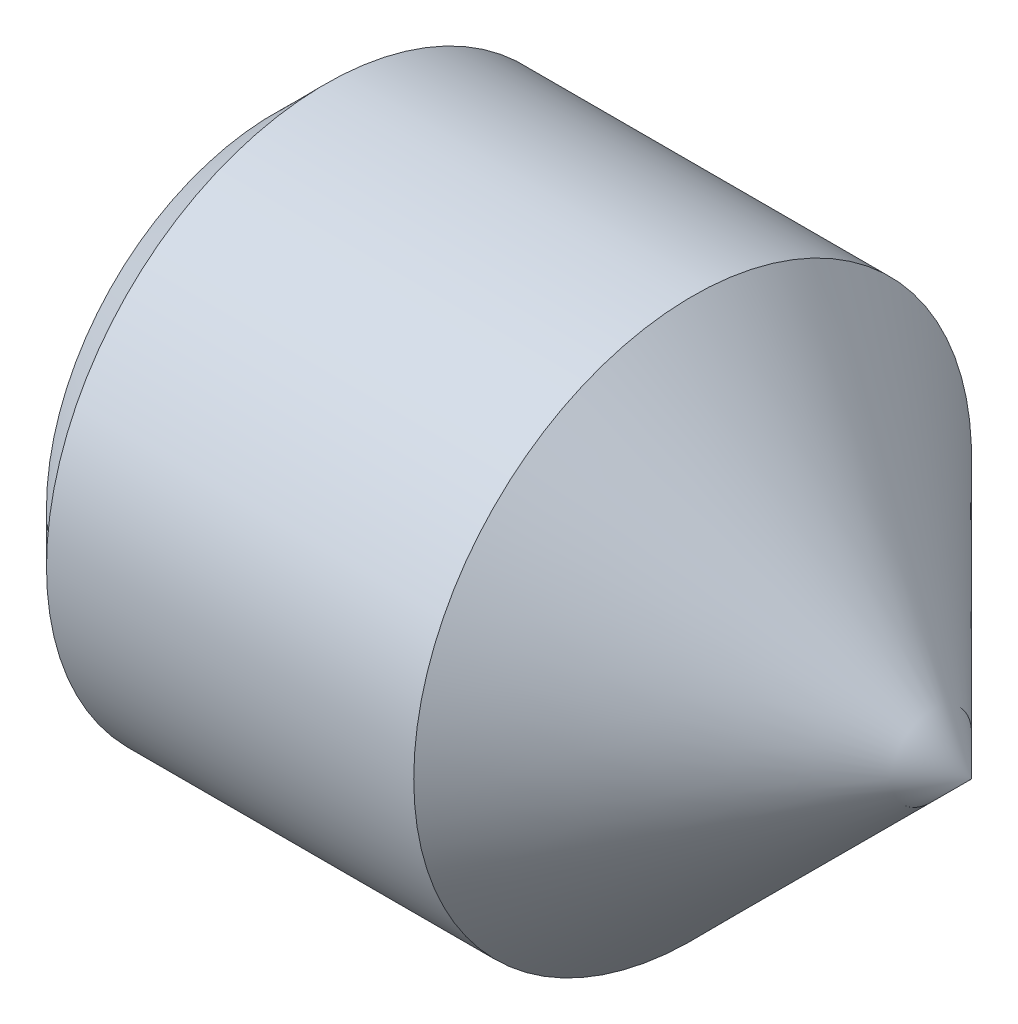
ISO-10303-21;
HEADER;
FILE_DESCRIPTION(('STEP AP214'),'2;1');
FILE_NAME('part.step','',(''),(''),'','','');
FILE_SCHEMA(('AUTOMOTIVE_DESIGN { 1 0 10303 214 1 1 1 1 }'));
ENDSEC;
DATA;
#1=APPLICATION_CONTEXT('core data for automotive mechanical design processes');
#2=APPLICATION_PROTOCOL_DEFINITION('international standard','automotive_design',2000,#1);
#3=PRODUCT_CONTEXT('',#1,'mechanical');
#4=PRODUCT('Part','Part','',(#3));
#5=PRODUCT_RELATED_PRODUCT_CATEGORY('part','',(#4));
#6=PRODUCT_DEFINITION_FORMATION('','',#4);
#7=PRODUCT_DEFINITION_CONTEXT('part definition',#1,'design');
#8=PRODUCT_DEFINITION('design','',#6,#7);
#9=PRODUCT_DEFINITION_SHAPE('','',#8);
#10=(LENGTH_UNIT() NAMED_UNIT(*) SI_UNIT(.MILLI.,.METRE.));
#11=(NAMED_UNIT(*) PLANE_ANGLE_UNIT() SI_UNIT($,.RADIAN.));
#12=(NAMED_UNIT(*) SI_UNIT($,.STERADIAN.) SOLID_ANGLE_UNIT());
#13=UNCERTAINTY_MEASURE_WITH_UNIT(LENGTH_MEASURE(1.E-05),#10,'distance_accuracy_value','');
#14=(GEOMETRIC_REPRESENTATION_CONTEXT(3) GLOBAL_UNCERTAINTY_ASSIGNED_CONTEXT((#13)) GLOBAL_UNIT_ASSIGNED_CONTEXT((#10,
#11,#12)) REPRESENTATION_CONTEXT('',''));
#15=CARTESIAN_POINT('',(0.,0.,0.));
#16=DIRECTION('',(0.,0.,1.));
#17=DIRECTION('',(1.,0.,0.));
#18=AXIS2_PLACEMENT_3D('',#15,#16,#17);
#19=CARTESIAN_POINT('',(0.,0.,0.));
#20=DIRECTION('',(-1.,0.,0.));
#21=DIRECTION('',(0.,0.,1.));
#22=AXIS2_PLACEMENT_3D('',#19,#20,#21);
#23=PLANE('',#22);
#24=CARTESIAN_POINT('',(0.,0.,0.));
#25=DIRECTION('',(-1.,0.,0.));
#26=DIRECTION('',(0.,0.,1.));
#27=AXIS2_PLACEMENT_3D('',#24,#25,#26);
#28=CIRCLE('',#27,5.18668);
#29=CARTESIAN_POINT('',(0.,0.,5.18668));
#30=VERTEX_POINT('',#29);
#31=EDGE_CURVE('E11',#30,#30,#28,.T.);
#32=ORIENTED_EDGE('',*,*,#31,.T.);
#33=EDGE_LOOP('',(#32));
#34=FACE_BOUND('',#33,.T.);
#35=DIRECTION('',(0.,0.,-1.));
#36=VECTOR('',#35,1.);
#37=CARTESIAN_POINT('',(0.,3.175,1.83308710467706));
#38=LINE('',#37,#36);
#39=CARTESIAN_POINT('',(0.,3.175,1.83308710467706));
#40=VERTEX_POINT('',#39);
#41=CARTESIAN_POINT('',(0.,3.175,-1.83308710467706));
#42=VERTEX_POINT('',#41);
#43=EDGE_CURVE('E93',#40,#42,#38,.T.);
#44=ORIENTED_EDGE('',*,*,#43,.F.);
#45=DIRECTION('',(0.,-0.866025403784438,0.5));
#46=VECTOR('',#45,1.);
#47=CARTESIAN_POINT('',(0.,3.175,1.83308710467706));
#48=LINE('',#47,#46);
#49=CARTESIAN_POINT('',(0.,0.,3.66617420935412));
#50=VERTEX_POINT('',#49);
#51=EDGE_CURVE('E46',#40,#50,#48,.T.);
#52=ORIENTED_EDGE('',*,*,#51,.T.);
#53=DIRECTION('',(0.,0.866025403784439,0.5));
#54=VECTOR('',#53,1.);
#55=CARTESIAN_POINT('',(0.,-3.175,1.83308710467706));
#56=LINE('',#55,#54);
#57=CARTESIAN_POINT('',(0.,-3.175,1.83308710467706));
#58=VERTEX_POINT('',#57);
#59=EDGE_CURVE('E99',#58,#50,#56,.T.);
#60=ORIENTED_EDGE('',*,*,#59,.F.);
#61=DIRECTION('',(0.,0.,-1.));
#62=VECTOR('',#61,1.);
#63=CARTESIAN_POINT('',(0.,-3.175,1.83308710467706));
#64=LINE('',#63,#62);
#65=CARTESIAN_POINT('',(0.,-3.175,-1.83308710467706));
#66=VERTEX_POINT('',#65);
#67=EDGE_CURVE('E119',#58,#66,#64,.T.);
#68=ORIENTED_EDGE('',*,*,#67,.T.);
#69=DIRECTION('',(0.,0.866025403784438,-0.5));
#70=VECTOR('',#69,1.);
#71=CARTESIAN_POINT('',(0.,-3.175,-1.83308710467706));
#72=LINE('',#71,#70);
#73=CARTESIAN_POINT('',(0.,0.,-3.66617420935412));
#74=VERTEX_POINT('',#73);
#75=EDGE_CURVE('E122',#66,#74,#72,.T.);
#76=ORIENTED_EDGE('',*,*,#75,.T.);
#77=DIRECTION('',(0.,-0.866025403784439,-0.5));
#78=VECTOR('',#77,1.);
#79=CARTESIAN_POINT('',(0.,3.175,-1.83308710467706));
#80=LINE('',#79,#78);
#81=EDGE_CURVE('E125',#42,#74,#80,.T.);
#82=ORIENTED_EDGE('',*,*,#81,.F.);
#83=EDGE_LOOP('',(#44,#52,#60,#68,#76,#82));
#84=FACE_BOUND('',#83,.T.);
#85=ADVANCED_FACE('F32',(#34,#84),#23,.T.);
#86=CARTESIAN_POINT('',(0.,0.,0.));
#87=DIRECTION('',(1.,0.,0.));
#88=DIRECTION('',(0.,0.,-1.));
#89=AXIS2_PLACEMENT_3D('',#86,#87,#88);
#90=CONICAL_SURFACE('',#89,5.18668,0.785398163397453);
#91=CARTESIAN_POINT('',(1.16331999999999,0.,0.));
#92=DIRECTION('',(-1.,0.,0.));
#93=DIRECTION('',(0.,0.,1.));
#94=AXIS2_PLACEMENT_3D('',#91,#92,#93);
#95=CIRCLE('',#94,6.35);
#96=CARTESIAN_POINT('',(1.16331999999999,0.,6.35));
#97=VERTEX_POINT('',#96);
#98=EDGE_CURVE('E39',#97,#97,#95,.T.);
#99=ORIENTED_EDGE('',*,*,#98,.T.);
#100=EDGE_LOOP('',(#99));
#101=FACE_BOUND('',#100,.T.);
#102=ORIENTED_EDGE('',*,*,#31,.F.);
#103=EDGE_LOOP('',(#102));
#104=FACE_BOUND('',#103,.T.);
#105=ADVANCED_FACE('F142',(#101,#104),#90,.T.);
#106=CARTESIAN_POINT('',(-12.7,0.,0.));
#107=DIRECTION('',(-1.,0.,0.));
#108=DIRECTION('',(0.,0.,1.));
#109=AXIS2_PLACEMENT_3D('',#106,#107,#108);
#110=CYLINDRICAL_SURFACE('',#109,6.35);
#111=CARTESIAN_POINT('',(9.52500000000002,0.,0.));
#112=DIRECTION('',(-1.,0.,0.));
#113=DIRECTION('',(0.,0.,1.));
#114=AXIS2_PLACEMENT_3D('',#111,#112,#113);
#115=CIRCLE('',#114,6.35);
#116=CARTESIAN_POINT('',(9.52500000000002,0.,6.35));
#117=VERTEX_POINT('',#116);
#118=EDGE_CURVE('E100',#117,#117,#115,.T.);
#119=ORIENTED_EDGE('',*,*,#118,.T.);
#120=EDGE_LOOP('',(#119));
#121=FACE_BOUND('',#120,.T.);
#122=ORIENTED_EDGE('',*,*,#98,.F.);
#123=EDGE_LOOP('',(#122));
#124=FACE_BOUND('',#123,.T.);
#125=ADVANCED_FACE('F145',(#121,#124),#110,.T.);
#126=CARTESIAN_POINT('',(9.52500000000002,0.,0.));
#127=DIRECTION('',(-1.,0.,0.));
#128=DIRECTION('',(0.,0.,1.));
#129=AXIS2_PLACEMENT_3D('',#126,#127,#128);
#130=CONICAL_SURFACE('',#129,6.35,0.78539816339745);
#131=CARTESIAN_POINT('',(15.875,0.,0.));
#132=VERTEX_POINT('',#131);
#133=VERTEX_LOOP('',#132);
#134=FACE_BOUND('',#133,.T.);
#135=ORIENTED_EDGE('',*,*,#118,.F.);
#136=EDGE_LOOP('',(#135));
#137=FACE_BOUND('',#136,.T.);
#138=ADVANCED_FACE('F147',(#134,#137),#130,.T.);
#139=CARTESIAN_POINT('',(6.35,3.175,1.83308710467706));
#140=DIRECTION('',(0.,-0.5,-0.866025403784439));
#141=DIRECTION('',(0.,0.866025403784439,-0.5));
#142=AXIS2_PLACEMENT_3D('',#139,#140,#141);
#143=PLANE('',#142);
#144=ORIENTED_EDGE('',*,*,#51,.F.);
#145=DIRECTION('',(-1.,0.,0.));
#146=VECTOR('',#145,1.);
#147=CARTESIAN_POINT('',(6.35,3.175,1.83308710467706));
#148=LINE('',#147,#146);
#149=CARTESIAN_POINT('',(6.35,3.175,1.83308710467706));
#150=VERTEX_POINT('',#149);
#151=EDGE_CURVE('E87',#150,#40,#148,.T.);
#152=ORIENTED_EDGE('',*,*,#151,.F.);
#153=DIRECTION('',(0.,-0.866025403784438,0.5));
#154=VECTOR('',#153,1.);
#155=CARTESIAN_POINT('',(6.35,3.175,1.83308710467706));
#156=LINE('',#155,#154);
#157=CARTESIAN_POINT('',(6.35,0.,3.66617420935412));
#158=VERTEX_POINT('',#157);
#159=EDGE_CURVE('E82',#150,#158,#156,.T.);
#160=ORIENTED_EDGE('',*,*,#159,.T.);
#161=DIRECTION('',(-1.,0.,0.));
#162=VECTOR('',#161,1.);
#163=CARTESIAN_POINT('',(6.35,0.,3.66617420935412));
#164=LINE('',#163,#162);
#165=EDGE_CURVE('E85',#158,#50,#164,.T.);
#166=ORIENTED_EDGE('',*,*,#165,.T.);
#167=EDGE_LOOP('',(#144,#152,#160,#166));
#168=FACE_BOUND('',#167,.T.);
#169=ADVANCED_FACE('F84',(#168),#143,.T.);
#170=CARTESIAN_POINT('',(6.35,-3.175,1.83308710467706));
#171=DIRECTION('',(0.,-0.5,0.866025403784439));
#172=DIRECTION('',(0.,-0.866025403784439,-0.5));
#173=AXIS2_PLACEMENT_3D('',#170,#171,#172);
#174=PLANE('',#173);
#175=ORIENTED_EDGE('',*,*,#59,.T.);
#176=ORIENTED_EDGE('',*,*,#165,.F.);
#177=DIRECTION('',(0.,0.866025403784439,0.5));
#178=VECTOR('',#177,1.);
#179=CARTESIAN_POINT('',(6.35,-3.175,1.83308710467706));
#180=LINE('',#179,#178);
#181=CARTESIAN_POINT('',(6.35,-3.175,1.83308710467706));
#182=VERTEX_POINT('',#181);
#183=EDGE_CURVE('E92',#182,#158,#180,.T.);
#184=ORIENTED_EDGE('',*,*,#183,.F.);
#185=DIRECTION('',(-1.,0.,0.));
#186=VECTOR('',#185,1.);
#187=CARTESIAN_POINT('',(6.35,-3.175,1.83308710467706));
#188=LINE('',#187,#186);
#189=EDGE_CURVE('E101',#182,#58,#188,.T.);
#190=ORIENTED_EDGE('',*,*,#189,.T.);
#191=EDGE_LOOP('',(#175,#176,#184,#190));
#192=FACE_BOUND('',#191,.T.);
#193=ADVANCED_FACE('F97',(#192),#174,.F.);
#194=CARTESIAN_POINT('',(6.35,-3.175,1.83308710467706));
#195=DIRECTION('',(0.,1.,0.));
#196=DIRECTION('',(0.,0.,1.));
#197=AXIS2_PLACEMENT_3D('',#194,#195,#196);
#198=PLANE('',#197);
#199=ORIENTED_EDGE('',*,*,#67,.F.);
#200=ORIENTED_EDGE('',*,*,#189,.F.);
#201=DIRECTION('',(0.,0.,-1.));
#202=VECTOR('',#201,1.);
#203=CARTESIAN_POINT('',(6.35,-3.175,1.83308710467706));
#204=LINE('',#203,#202);
#205=CARTESIAN_POINT('',(6.35,-3.175,-1.83308710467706));
#206=VERTEX_POINT('',#205);
#207=EDGE_CURVE('E106',#182,#206,#204,.T.);
#208=ORIENTED_EDGE('',*,*,#207,.T.);
#209=DIRECTION('',(-1.,0.,0.));
#210=VECTOR('',#209,1.);
#211=CARTESIAN_POINT('',(6.35,-3.175,-1.83308710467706));
#212=LINE('',#211,#210);
#213=EDGE_CURVE('E135',#206,#66,#212,.T.);
#214=ORIENTED_EDGE('',*,*,#213,.T.);
#215=EDGE_LOOP('',(#199,#200,#208,#214));
#216=FACE_BOUND('',#215,.T.);
#217=ADVANCED_FACE('F175',(#216),#198,.T.);
#218=CARTESIAN_POINT('',(6.35,-3.175,-1.83308710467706));
#219=DIRECTION('',(0.,0.5,0.866025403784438));
#220=DIRECTION('',(0.,-0.866025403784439,0.5));
#221=AXIS2_PLACEMENT_3D('',#218,#219,#220);
#222=PLANE('',#221);
#223=ORIENTED_EDGE('',*,*,#75,.F.);
#224=ORIENTED_EDGE('',*,*,#213,.F.);
#225=DIRECTION('',(0.,0.866025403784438,-0.5));
#226=VECTOR('',#225,1.);
#227=CARTESIAN_POINT('',(6.35,-3.175,-1.83308710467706));
#228=LINE('',#227,#226);
#229=CARTESIAN_POINT('',(6.35,0.,-3.66617420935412));
#230=VERTEX_POINT('',#229);
#231=EDGE_CURVE('E108',#206,#230,#228,.T.);
#232=ORIENTED_EDGE('',*,*,#231,.T.);
#233=DIRECTION('',(-1.,0.,0.));
#234=VECTOR('',#233,1.);
#235=CARTESIAN_POINT('',(6.35,0.,-3.66617420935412));
#236=LINE('',#235,#234);
#237=EDGE_CURVE('E133',#230,#74,#236,.T.);
#238=ORIENTED_EDGE('',*,*,#237,.T.);
#239=EDGE_LOOP('',(#223,#224,#232,#238));
#240=FACE_BOUND('',#239,.T.);
#241=ADVANCED_FACE('F171',(#240),#222,.T.);
#242=CARTESIAN_POINT('',(6.35,3.175,-1.83308710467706));
#243=DIRECTION('',(0.,0.5,-0.866025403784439));
#244=DIRECTION('',(0.,0.866025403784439,0.5));
#245=AXIS2_PLACEMENT_3D('',#242,#243,#244);
#246=PLANE('',#245);
#247=ORIENTED_EDGE('',*,*,#81,.T.);
#248=ORIENTED_EDGE('',*,*,#237,.F.);
#249=DIRECTION('',(0.,-0.866025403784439,-0.5));
#250=VECTOR('',#249,1.);
#251=CARTESIAN_POINT('',(6.35,3.175,-1.83308710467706));
#252=LINE('',#251,#250);
#253=CARTESIAN_POINT('',(6.35,3.175,-1.83308710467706));
#254=VERTEX_POINT('',#253);
#255=EDGE_CURVE('E112',#254,#230,#252,.T.);
#256=ORIENTED_EDGE('',*,*,#255,.F.);
#257=DIRECTION('',(-1.,0.,0.));
#258=VECTOR('',#257,1.);
#259=CARTESIAN_POINT('',(6.35,3.175,-1.83308710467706));
#260=LINE('',#259,#258);
#261=EDGE_CURVE('E131',#254,#42,#260,.T.);
#262=ORIENTED_EDGE('',*,*,#261,.T.);
#263=EDGE_LOOP('',(#247,#248,#256,#262));
#264=FACE_BOUND('',#263,.T.);
#265=ADVANCED_FACE('F168',(#264),#246,.F.);
#266=CARTESIAN_POINT('',(6.35,3.175,1.83308710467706));
#267=DIRECTION('',(0.,1.,0.));
#268=DIRECTION('',(0.,0.,1.));
#269=AXIS2_PLACEMENT_3D('',#266,#267,#268);
#270=PLANE('',#269);
#271=ORIENTED_EDGE('',*,*,#43,.T.);
#272=ORIENTED_EDGE('',*,*,#261,.F.);
#273=DIRECTION('',(0.,0.,-1.));
#274=VECTOR('',#273,1.);
#275=CARTESIAN_POINT('',(6.35,3.175,1.83308710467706));
#276=LINE('',#275,#274);
#277=EDGE_CURVE('E115',#150,#254,#276,.T.);
#278=ORIENTED_EDGE('',*,*,#277,.F.);
#279=ORIENTED_EDGE('',*,*,#151,.T.);
#280=EDGE_LOOP('',(#271,#272,#278,#279));
#281=FACE_BOUND('',#280,.T.);
#282=ADVANCED_FACE('F164',(#281),#270,.F.);
#283=CARTESIAN_POINT('',(6.35,0.,3.66617420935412));
#284=DIRECTION('',(-1.,0.,0.));
#285=DIRECTION('',(0.,0.,1.));
#286=AXIS2_PLACEMENT_3D('',#283,#284,#285);
#287=PLANE('',#286);
#288=ORIENTED_EDGE('',*,*,#159,.F.);
#289=ORIENTED_EDGE('',*,*,#277,.T.);
#290=ORIENTED_EDGE('',*,*,#255,.T.);
#291=ORIENTED_EDGE('',*,*,#231,.F.);
#292=ORIENTED_EDGE('',*,*,#207,.F.);
#293=ORIENTED_EDGE('',*,*,#183,.T.);
#294=EDGE_LOOP('',(#288,#289,#290,#291,#292,#293));
#295=FACE_BOUND('',#294,.T.);
#296=ADVANCED_FACE('F104',(#295),#287,.T.);
#297=CLOSED_SHELL('',(#85,#105,#125,#138,#169,#193,#217,#241,#265,#282,#296));
#298=MANIFOLD_SOLID_BREP('B2',#297);
#299=ADVANCED_BREP_SHAPE_REPRESENTATION('',(#18,#298),#14);
#300=SHAPE_DEFINITION_REPRESENTATION(#9,#299);
ENDSEC;
END-ISO-10303-21;
